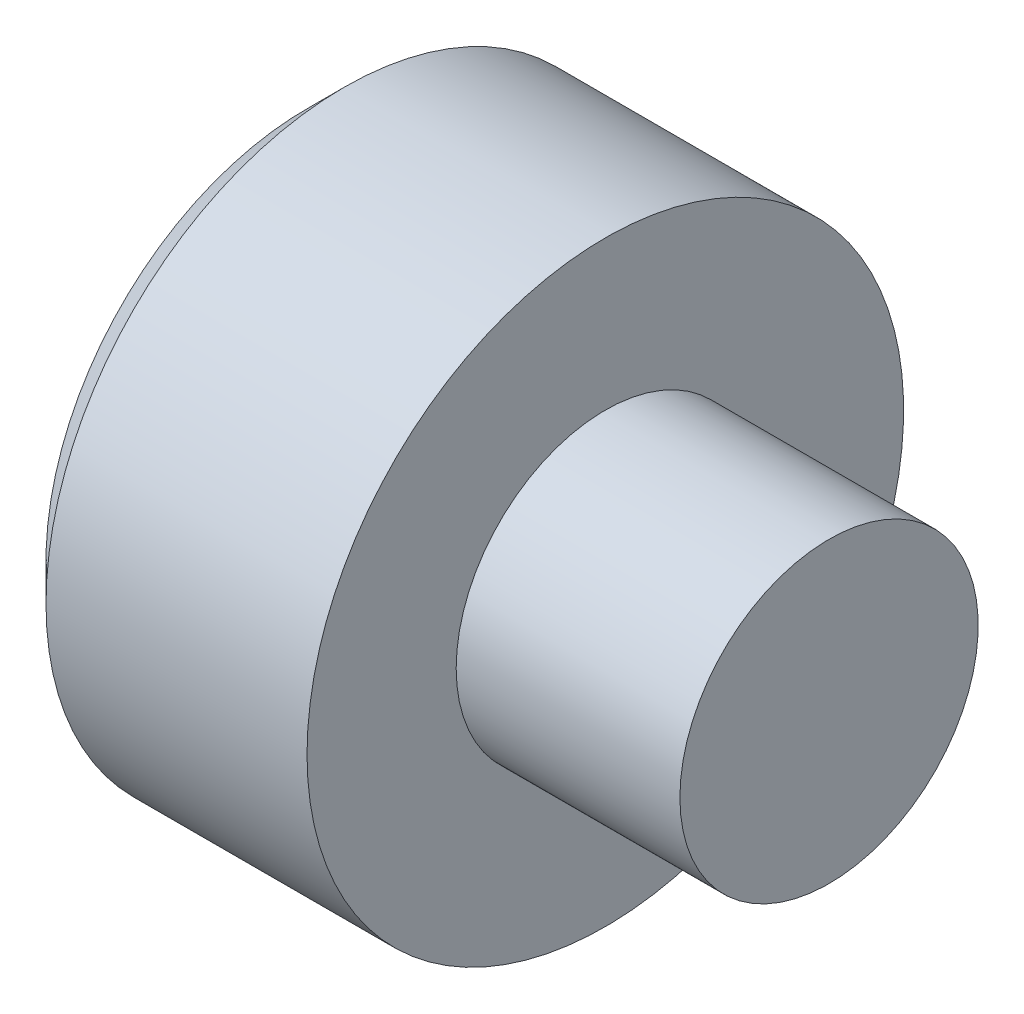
from build123d import *

# Parameters (mm, degrees)
CHANFREIN1_SIZE = 0.5


with BuildPart() as part:
    # Esquisse1 → Base-R_volution (revolve)
    with BuildSketch(Plane.XY, mode=Mode.PRIVATE) as base_r_volution_sk:
        Polygon((0, 0), (0, 4), (4, 4), (4, 2), (7, 2), (7, 0), align=None)
    revolve(base_r_volution_sk.sketch.rotate(Axis((-17.156140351, 0, 0), (1, 0, 0)), 90), axis=Axis((-17.156140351, 0, 0), (1, 0, 0)))

    # Chanfrein1
    chanfrein1_edges = [part.edges().sort_by_distance(p)[0] for p in [
        (0, 0, -4),
    ]]
    chamfer(chanfrein1_edges, length=CHANFREIN1_SIZE)


solid = part.part
